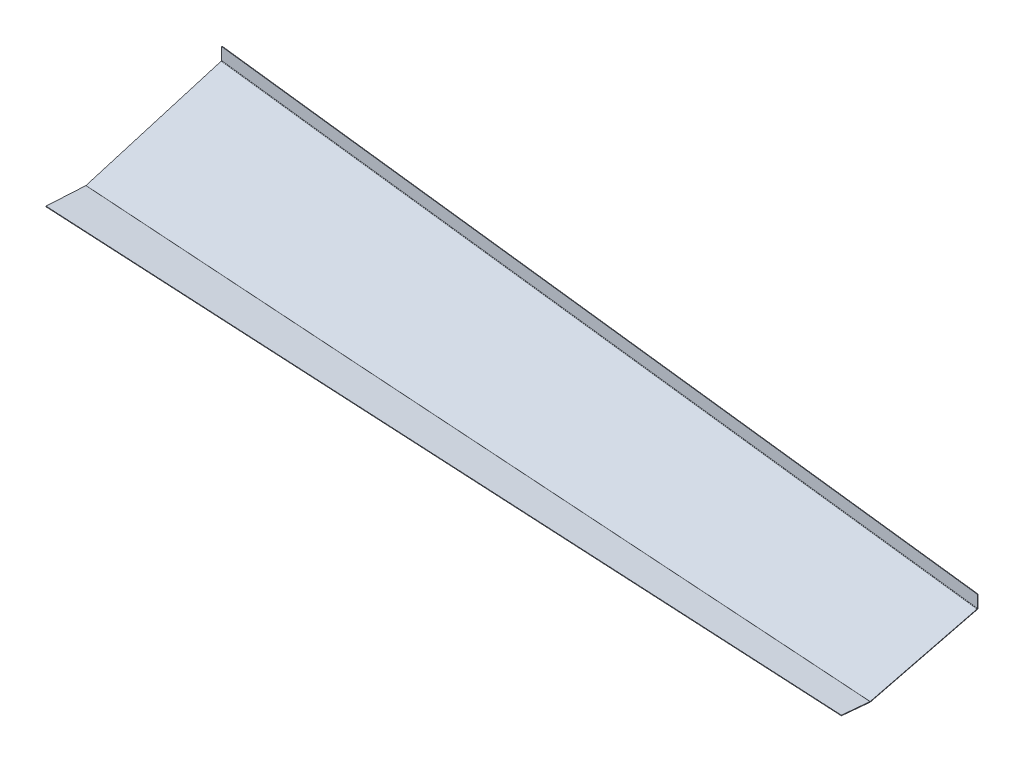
ISO-10303-21;
HEADER;
FILE_DESCRIPTION(('STEP AP214'),'2;1');
FILE_NAME('part.step','',(''),(''),'','','');
FILE_SCHEMA(('AUTOMOTIVE_DESIGN { 1 0 10303 214 1 1 1 1 }'));
ENDSEC;
DATA;
#1=APPLICATION_CONTEXT('core data for automotive mechanical design processes');
#2=APPLICATION_PROTOCOL_DEFINITION('international standard','automotive_design',2000,#1);
#3=PRODUCT_CONTEXT('',#1,'mechanical');
#4=PRODUCT('Part','Part','',(#3));
#5=PRODUCT_RELATED_PRODUCT_CATEGORY('part','',(#4));
#6=PRODUCT_DEFINITION_FORMATION('','',#4);
#7=PRODUCT_DEFINITION_CONTEXT('part definition',#1,'design');
#8=PRODUCT_DEFINITION('design','',#6,#7);
#9=PRODUCT_DEFINITION_SHAPE('','',#8);
#10=(LENGTH_UNIT() NAMED_UNIT(*) SI_UNIT(.MILLI.,.METRE.));
#11=(NAMED_UNIT(*) PLANE_ANGLE_UNIT() SI_UNIT($,.RADIAN.));
#12=(NAMED_UNIT(*) SI_UNIT($,.STERADIAN.) SOLID_ANGLE_UNIT());
#13=UNCERTAINTY_MEASURE_WITH_UNIT(LENGTH_MEASURE(1.E-05),#10,'distance_accuracy_value','');
#14=(GEOMETRIC_REPRESENTATION_CONTEXT(3) GLOBAL_UNCERTAINTY_ASSIGNED_CONTEXT((#13)) GLOBAL_UNIT_ASSIGNED_CONTEXT((#10,
#11,#12)) REPRESENTATION_CONTEXT('',''));
#15=CARTESIAN_POINT('',(0.,0.,0.));
#16=DIRECTION('',(0.,0.,1.));
#17=DIRECTION('',(1.,0.,0.));
#18=AXIS2_PLACEMENT_3D('',#15,#16,#17);
#19=CARTESIAN_POINT('',(-98.9377223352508,-360.42650834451,-114.930927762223));
#20=DIRECTION('',(-0.997086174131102,-0.0111059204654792,-0.0754706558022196));
#21=DIRECTION('',(-0.0691618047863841,-0.285793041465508,0.955792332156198));
#22=AXIS2_PLACEMENT_3D('',#19,#20,#21);
#23=PLANE('',#22);
#24=DIRECTION('',(-0.0321839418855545,0.95822700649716,0.284192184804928));
#25=VECTOR('',#24,1.);
#26=CARTESIAN_POINT('',(-44.5595716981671,-135.723045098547,-866.418249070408));
#27=LINE('',#26,#25);
#28=CARTESIAN_POINT('',(-44.5072534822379,-137.280738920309,-866.880231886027));
#29=VERTEX_POINT('',#28);
#30=CARTESIAN_POINT('',(-44.5595716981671,-135.723045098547,-866.418249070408));
#31=VERTEX_POINT('',#30);
#32=EDGE_CURVE('E13',#29,#31,#27,.T.);
#33=ORIENTED_EDGE('',*,*,#32,.F.);
#34=DIRECTION('',(-0.0691618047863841,-0.285793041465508,0.955792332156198));
#35=VECTOR('',#34,1.);
#36=CARTESIAN_POINT('',(-98.8854041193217,-361.984202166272,-115.392910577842));
#37=LINE('',#36,#35);
#38=CARTESIAN_POINT('',(-44.4850191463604,-137.188861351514,-867.187502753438));
#39=VERTEX_POINT('',#38);
#40=EDGE_CURVE('E370',#39,#29,#37,.T.);
#41=ORIENTED_EDGE('',*,*,#40,.F.);
#42=DIRECTION('',(-0.0321839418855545,0.95822700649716,0.284192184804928));
#43=VECTOR('',#42,1.);
#44=CARTESIAN_POINT('',(-44.5373373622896,-135.631167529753,-866.725519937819));
#45=LINE('',#44,#43);
#46=CARTESIAN_POINT('',(-44.5373373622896,-135.631167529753,-866.725519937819));
#47=VERTEX_POINT('',#46);
#48=EDGE_CURVE('E205',#39,#47,#45,.T.);
#49=ORIENTED_EDGE('',*,*,#48,.T.);
#50=DIRECTION('',(-0.0691618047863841,-0.285793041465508,0.955792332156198));
#51=VECTOR('',#50,1.);
#52=CARTESIAN_POINT('',(-98.9377223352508,-360.42650834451,-114.930927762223));
#53=LINE('',#52,#51);
#54=EDGE_CURVE('E465',#47,#31,#53,.T.);
#55=ORIENTED_EDGE('',*,*,#54,.T.);
#56=EDGE_LOOP('',(#33,#41,#49,#55));
#57=FACE_BOUND('',#56,.T.);
#58=ADVANCED_FACE('F194',(#57),#23,.F.);
#59=CARTESIAN_POINT('',(-32.7570325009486,-44.8590499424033,-1171.45296316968));
#60=DIRECTION('',(-0.998795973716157,-0.0203014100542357,-0.0446593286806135));
#61=DIRECTION('',(-0.0370242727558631,-0.285287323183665,0.95772665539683));
#62=AXIS2_PLACEMENT_3D('',#59,#60,#61);
#63=PLANE('',#62);
#64=ORIENTED_EDGE('',*,*,#48,.F.);
#65=DIRECTION('',(-0.0370242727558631,-0.285287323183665,0.95772665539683));
#66=VECTOR('',#65,1.);
#67=CARTESIAN_POINT('',(-32.7047142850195,-46.4167437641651,-1171.9149459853));
#68=LINE('',#67,#66);
#69=CARTESIAN_POINT('',(-32.7501898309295,-46.7671516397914,-1170.73860572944));
#70=VERTEX_POINT('',#69);
#71=EDGE_CURVE('E400',#70,#39,#68,.T.);
#72=ORIENTED_EDGE('',*,*,#71,.F.);
#73=DIRECTION('',(-0.0321839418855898,0.958227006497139,0.284192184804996));
#74=VECTOR('',#73,1.);
#75=CARTESIAN_POINT('',(-32.8025080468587,-45.2094578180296,-1170.27662291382));
#76=LINE('',#75,#74);
#77=CARTESIAN_POINT('',(-32.8025080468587,-45.2094578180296,-1170.27662291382));
#78=VERTEX_POINT('',#77);
#79=EDGE_CURVE('E459',#70,#78,#76,.T.);
#80=ORIENTED_EDGE('',*,*,#79,.T.);
#81=DIRECTION('',(-0.0370242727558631,-0.285287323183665,0.95772665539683));
#82=VECTOR('',#81,1.);
#83=CARTESIAN_POINT('',(-32.7570325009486,-44.8590499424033,-1171.45296316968));
#84=LINE('',#83,#82);
#85=EDGE_CURVE('E469',#78,#47,#84,.T.);
#86=ORIENTED_EDGE('',*,*,#85,.T.);
#87=EDGE_LOOP('',(#64,#72,#80,#86));
#88=FACE_BOUND('',#87,.T.);
#89=ADVANCED_FACE('F470',(#88),#63,.F.);
#90=CARTESIAN_POINT('',(-32.8876456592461,-43.6951706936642,-1168.18294925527));
#91=CARTESIAN_POINT('',(-32.9485989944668,-43.7096395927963,-1167.64471619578));
#92=CARTESIAN_POINT('',(-33.0095523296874,-43.7241084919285,-1167.10648313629));
#93=CARTESIAN_POINT('',(-33.0705056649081,-43.7385773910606,-1166.5682500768));
#94=CARTESIAN_POINT('',(-32.8778767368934,-46.9452114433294,-1168.26921126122));
#95=CARTESIAN_POINT('',(-32.9355737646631,-48.0430272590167,-1167.75973220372));
#96=CARTESIAN_POINT('',(-32.9932707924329,-49.1408430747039,-1167.25025314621));
#97=CARTESIAN_POINT('',(-33.0509678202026,-50.238658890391,-1166.74077408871));
#98=CARTESIAN_POINT('',(-32.7502559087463,-46.8583980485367,-1171.5255736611));
#99=CARTESIAN_POINT('',(-32.6860462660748,-47.9272760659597,-1172.09256072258));
#100=CARTESIAN_POINT('',(-32.6218366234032,-48.9961540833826,-1172.65954778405));
#101=CARTESIAN_POINT('',(-32.5576269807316,-50.0650321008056,-1173.22653484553));
#102=CARTESIAN_POINT('',(-32.760024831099,-43.6083572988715,-1171.43931165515));
#103=CARTESIAN_POINT('',(-32.6990714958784,-43.5938883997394,-1171.97754471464));
#104=CARTESIAN_POINT('',(-32.6381181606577,-43.5794195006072,-1172.51577777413));
#105=CARTESIAN_POINT('',(-32.5771648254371,-43.5649506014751,-1173.05401083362));
#106=CARTESIAN_POINT('',(-32.7697937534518,-40.3583165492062,-1171.35304964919));
#107=CARTESIAN_POINT('',(-32.712096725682,-39.2605007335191,-1171.8625287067));
#108=CARTESIAN_POINT('',(-32.6543996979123,-38.1626849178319,-1172.3720077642));
#109=CARTESIAN_POINT('',(-32.5967026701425,-37.0648691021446,-1172.8814868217));
#110=CARTESIAN_POINT('',(-32.8974145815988,-40.445129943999,-1168.09668724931));
#111=CARTESIAN_POINT('',(-32.9616242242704,-39.376251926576,-1167.52970018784));
#112=CARTESIAN_POINT('',(-33.025833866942,-38.3073739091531,-1166.96271312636));
#113=CARTESIAN_POINT('',(-33.0900435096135,-37.2384958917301,-1166.39572606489));
#114=CARTESIAN_POINT('',(-32.8876456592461,-43.6951706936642,-1168.18294925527));
#115=CARTESIAN_POINT('',(-32.9485989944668,-43.7096395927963,-1167.64471619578));
#116=CARTESIAN_POINT('',(-33.0095523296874,-43.7241084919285,-1167.10648313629));
#117=CARTESIAN_POINT('',(-33.0705056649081,-43.7385773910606,-1166.5682500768));
#118=(BOUNDED_SURFACE() B_SPLINE_SURFACE(3,3,((#90,#91,#92,#93),(#94,#95,#96,#97),(#98,#99,#100,
#101),(#102,#103,#104,#105),(#106,#107,#108,#109),(#110,#111,#112,#113),(#114,#115,#116,#117)),
.UNSPECIFIED.,.T.,.F.,.F.) B_SPLINE_SURFACE_WITH_KNOTS((4,3,4),(4,4),(0.,0.5,1.),(0.,1.),
.UNSPECIFIED.) GEOMETRIC_REPRESENTATION_ITEM() RATIONAL_B_SPLINE_SURFACE(((1.,1.,1.,1.),
(0.333333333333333,0.333333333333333,0.333333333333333,0.333333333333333),(0.333333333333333,
0.333333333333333,0.333333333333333,0.333333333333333),(1.,1.,1.,1.),(0.333333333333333,
0.333333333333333,0.333333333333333,0.333333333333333),(0.333333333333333,0.333333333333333,
0.333333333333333,0.333333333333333),(1.,1.,1.,1.))) REPRESENTATION_ITEM('') SURFACE());
#119=CARTESIAN_POINT('',(-32.8238352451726,-43.6517639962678,-1169.81113045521));
#120=DIRECTION('',(0.997117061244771,0.000983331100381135,0.0758722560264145));
#121=DIRECTION('',(-0.0758191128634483,-0.0266838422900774,0.996764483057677));
#122=AXIS2_PLACEMENT_3D('',#119,#120,#121);
#123=ELLIPSE('',#122,3.2534068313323,3.2512);
#124=CARTESIAN_POINT('',(-32.5769919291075,-43.6517639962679,-1173.0551579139));
#125=VERTEX_POINT('',#124);
#126=EDGE_CURVE('E404',#70,#125,#123,.T.);
#127=DIRECTION('',(-0.11252782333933,0.,0.993648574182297));
#128=VECTOR('',#127,1.);
#129=CARTESIAN_POINT('',(-32.7599171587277,-43.6517639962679,-1171.43988279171));
#130=LINE('',#129,#128);
#131=CARTESIAN_POINT('',(-32.7599171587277,-43.6517639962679,-1171.43988279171));
#132=VERTEX_POINT('',#131);
#133=EDGE_CURVE('E454',#125,#132,#130,.T.);
#134=CARTESIAN_POINT('',(-32.8238352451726,-43.6517639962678,-1169.81113045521));
#135=DIRECTION('',(0.999228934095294,0.00196267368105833,0.0392133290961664));
#136=DIRECTION('',(-0.039147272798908,-0.0266297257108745,0.998878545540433));
#137=AXIS2_PLACEMENT_3D('',#134,#135,#136);
#138=ELLIPSE('',#137,1.63000918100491,1.6256);
#139=EDGE_CURVE('E356',#78,#132,#138,.T.);
#140=ORIENTED_EDGE('',*,*,#79,.F.);
#141=ORIENTED_EDGE('',*,*,#126,.T.);
#142=ORIENTED_EDGE('',*,*,#133,.T.);
#143=ORIENTED_EDGE('',*,*,#139,.F.);
#144=EDGE_LOOP('',(#140,#141,#142,#143));
#145=FACE_BOUND('',#144,.T.);
#146=ADVANCED_FACE('F567',(#145),#118,.F.);
#147=CARTESIAN_POINT('',(-32.755177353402,-46.0756,-1171.43934602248));
#148=DIRECTION('',(-0.99364664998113,-0.00196799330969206,-0.11252760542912));
#149=DIRECTION('',(-0.00195549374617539,0.999998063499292,-0.000221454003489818));
#150=AXIS2_PLACEMENT_3D('',#147,#148,#149);
#151=PLANE('',#150);
#152=ORIENTED_EDGE('',*,*,#133,.F.);
#153=DIRECTION('',(-0.00195549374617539,0.999998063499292,-0.000221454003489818));
#154=VECTOR('',#153,1.);
#155=CARTESIAN_POINT('',(-32.5722521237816,-46.0756,-1173.05462114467));
#156=LINE('',#155,#154);
#157=CARTESIAN_POINT('',(-32.6467565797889,-7.97559999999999,-1173.06305855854));
#158=VERTEX_POINT('',#157);
#159=EDGE_CURVE('E379',#125,#158,#156,.T.);
#160=ORIENTED_EDGE('',*,*,#159,.T.);
#161=DIRECTION('',(-0.11252782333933,0.,0.993648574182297));
#162=VECTOR('',#161,1.);
#163=CARTESIAN_POINT('',(-32.8296818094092,-7.97559999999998,-1171.44778343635));
#164=LINE('',#163,#162);
#165=CARTESIAN_POINT('',(-32.8296818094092,-7.97559999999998,-1171.44778343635));
#166=VERTEX_POINT('',#165);
#167=EDGE_CURVE('E451',#158,#166,#164,.T.);
#168=ORIENTED_EDGE('',*,*,#167,.T.);
#169=DIRECTION('',(-0.00195549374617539,0.999998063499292,-0.000221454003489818));
#170=VECTOR('',#169,1.);
#171=CARTESIAN_POINT('',(-32.755177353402,-46.0756,-1171.43934602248));
#172=LINE('',#171,#170);
#173=EDGE_CURVE('E489',#132,#166,#172,.T.);
#174=ORIENTED_EDGE('',*,*,#173,.F.);
#175=EDGE_LOOP('',(#152,#160,#168,#174));
#176=FACE_BOUND('',#175,.T.);
#177=ADVANCED_FACE('F535',(#176),#151,.F.);
#178=CARTESIAN_POINT('',(-32.8296818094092,-7.97559999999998,-1171.44778343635));
#179=DIRECTION('',(0.,-1.,0.));
#180=DIRECTION('',(-0.993648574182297,0.,-0.11252782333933));
#181=AXIS2_PLACEMENT_3D('',#178,#179,#180);
#182=PLANE('',#181);
#183=ORIENTED_EDGE('',*,*,#167,.F.);
#184=DIRECTION('',(-0.993648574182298,0.,-0.11252782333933));
#185=VECTOR('',#184,1.);
#186=CARTESIAN_POINT('',(130.869125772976,-7.9756,-1154.54535843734));
#187=LINE('',#186,#185);
#188=CARTESIAN_POINT('',(-2552.51707477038,-7.97559999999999,-1458.43107434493));
#189=VERTEX_POINT('',#188);
#190=EDGE_CURVE('E409',#158,#189,#187,.T.);
#191=ORIENTED_EDGE('',*,*,#190,.T.);
#192=DIRECTION('',(-0.11252782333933,0.,0.993648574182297));
#193=VECTOR('',#192,1.);
#194=CARTESIAN_POINT('',(-2552.7,-7.97559999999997,-1456.81579922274));
#195=LINE('',#194,#193);
#196=CARTESIAN_POINT('',(-2552.7,-7.97559999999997,-1456.81579922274));
#197=VERTEX_POINT('',#196);
#198=EDGE_CURVE('E448',#189,#197,#195,.T.);
#199=ORIENTED_EDGE('',*,*,#198,.T.);
#200=DIRECTION('',(-0.993648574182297,0.,-0.11252782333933));
#201=VECTOR('',#200,1.);
#202=CARTESIAN_POINT('',(-32.8296818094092,-7.97559999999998,-1171.44778343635));
#203=LINE('',#202,#201);
#204=EDGE_CURVE('E474',#166,#197,#203,.T.);
#205=ORIENTED_EDGE('',*,*,#204,.F.);
#206=EDGE_LOOP('',(#183,#191,#199,#205));
#207=FACE_BOUND('',#206,.T.);
#208=ADVANCED_FACE('F537',(#207),#182,.F.);
#209=CARTESIAN_POINT('',(-2552.7,-1.86058804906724E-11,-1456.81579922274));
#210=DIRECTION('',(0.993648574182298,0.,0.11252782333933));
#211=DIRECTION('',(0.,-1.,0.));
#212=AXIS2_PLACEMENT_3D('',#209,#210,#211);
#213=PLANE('',#212);
#214=ORIENTED_EDGE('',*,*,#198,.F.);
#215=DIRECTION('',(0.,1.,0.));
#216=VECTOR('',#215,1.);
#217=CARTESIAN_POINT('',(-2552.51707477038,-1.4749395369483E-11,-1458.43107434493));
#218=LINE('',#217,#216);
#219=CARTESIAN_POINT('',(-2552.51707477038,-43.6517639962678,-1458.43107434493));
#220=VERTEX_POINT('',#219);
#221=EDGE_CURVE('E405',#189,#220,#218,.F.);
#222=ORIENTED_EDGE('',*,*,#221,.T.);
#223=DIRECTION('',(-0.112527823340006,0.,0.993648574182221));
#224=VECTOR('',#223,1.);
#225=CARTESIAN_POINT('',(-2552.7,-43.6517639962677,-1456.81579922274));
#226=LINE('',#225,#224);
#227=CARTESIAN_POINT('',(-2552.7,-43.6517639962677,-1456.81579922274));
#228=VERTEX_POINT('',#227);
#229=EDGE_CURVE('E445',#220,#228,#226,.T.);
#230=ORIENTED_EDGE('',*,*,#229,.T.);
#231=DIRECTION('',(0.,-1.,0.));
#232=VECTOR('',#231,1.);
#233=CARTESIAN_POINT('',(-2552.7,-1.86058804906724E-11,-1456.81579922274));
#234=LINE('',#233,#232);
#235=EDGE_CURVE('E493',#197,#228,#234,.T.);
#236=ORIENTED_EDGE('',*,*,#235,.F.);
#237=EDGE_LOOP('',(#214,#222,#230,#236));
#238=FACE_BOUND('',#237,.T.);
#239=ADVANCED_FACE('F540',(#238),#213,.F.);
#240=CARTESIAN_POINT('',(-2552.7,-43.6517639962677,-1453.54381747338));
#241=CARTESIAN_POINT('',(-2552.76097507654,-43.6517639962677,-1453.00539243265));
#242=CARTESIAN_POINT('',(-2552.82195015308,-43.6517639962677,-1452.46696739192));
#243=CARTESIAN_POINT('',(-2552.88292522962,-43.6517639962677,-1451.92854235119));
#244=CARTESIAN_POINT('',(-2552.7,-40.4005639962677,-1453.54381747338));
#245=CARTESIAN_POINT('',(-2552.76097507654,-39.3168306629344,-1453.00539243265));
#246=CARTESIAN_POINT('',(-2552.82195015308,-38.2330973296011,-1452.46696739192));
#247=CARTESIAN_POINT('',(-2552.88292522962,-37.1493639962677,-1451.92854235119));
#248=CARTESIAN_POINT('',(-2552.7,-40.4005639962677,-1456.81579922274));
#249=CARTESIAN_POINT('',(-2552.63902492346,-39.3168306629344,-1457.35422426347));
#250=CARTESIAN_POINT('',(-2552.57804984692,-38.2330973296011,-1457.8926493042));
#251=CARTESIAN_POINT('',(-2552.51707477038,-37.1493639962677,-1458.43107434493));
#252=CARTESIAN_POINT('',(-2552.7,-43.6517639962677,-1456.81579922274));
#253=CARTESIAN_POINT('',(-2552.63902492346,-43.6517639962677,-1457.35422426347));
#254=CARTESIAN_POINT('',(-2552.57804984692,-43.6517639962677,-1457.8926493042));
#255=CARTESIAN_POINT('',(-2552.51707477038,-43.6517639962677,-1458.43107434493));
#256=CARTESIAN_POINT('',(-2552.7,-46.9029639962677,-1456.81579922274));
#257=CARTESIAN_POINT('',(-2552.63902492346,-47.9866973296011,-1457.35422426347));
#258=CARTESIAN_POINT('',(-2552.57804984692,-49.0704306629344,-1457.8926493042));
#259=CARTESIAN_POINT('',(-2552.51707477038,-50.1541639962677,-1458.43107434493));
#260=CARTESIAN_POINT('',(-2552.7,-46.9029639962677,-1453.54381747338));
#261=CARTESIAN_POINT('',(-2552.76097507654,-47.9866973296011,-1453.00539243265));
#262=CARTESIAN_POINT('',(-2552.82195015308,-49.0704306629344,-1452.46696739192));
#263=CARTESIAN_POINT('',(-2552.88292522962,-50.1541639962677,-1451.92854235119));
#264=CARTESIAN_POINT('',(-2552.7,-43.6517639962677,-1453.54381747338));
#265=CARTESIAN_POINT('',(-2552.76097507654,-43.6517639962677,-1453.00539243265));
#266=CARTESIAN_POINT('',(-2552.82195015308,-43.6517639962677,-1452.46696739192));
#267=CARTESIAN_POINT('',(-2552.88292522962,-43.6517639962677,-1451.92854235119));
#268=(BOUNDED_SURFACE() B_SPLINE_SURFACE(3,3,((#240,#241,#242,#243),(#244,#245,#246,#247),(#248,
#249,#250,#251),(#252,#253,#254,#255),(#256,#257,#258,#259),(#260,#261,#262,#263),(#264,#265,
#266,#267)),.UNSPECIFIED.,.T.,.F.,.F.) B_SPLINE_SURFACE_WITH_KNOTS((4,3,4),(4,4),(0.,0.5,1.),
(0.,1.),.UNSPECIFIED.) GEOMETRIC_REPRESENTATION_ITEM() RATIONAL_B_SPLINE_SURFACE(((1.,1.,1.,1.),
(0.333333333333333,0.333333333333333,0.333333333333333,0.333333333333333),(0.333333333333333,
0.333333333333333,0.333333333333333,0.333333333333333),(1.,1.,1.,1.),(0.333333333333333,
0.333333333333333,0.333333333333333,0.333333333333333),(0.333333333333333,0.333333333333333,
0.333333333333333,0.333333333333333),(1.,1.,1.,1.))) REPRESENTATION_ITEM('') SURFACE());
#269=CARTESIAN_POINT('',(-2552.7,-43.6517639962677,-1455.17980834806));
#270=DIRECTION('',(-0.99842099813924,0.,-0.0561739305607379));
#271=DIRECTION('',(-0.0561739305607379,0.,0.99842099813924));
#272=AXIS2_PLACEMENT_3D('',#269,#270,#271);
#273=ELLIPSE('',#272,3.25640787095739,3.2512);
#274=CARTESIAN_POINT('',(-2552.64768178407,-46.7671516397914,-1456.10969886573));
#275=VERTEX_POINT('',#274);
#276=EDGE_CURVE('E393',#220,#275,#273,.T.);
#277=DIRECTION('',(-0.0321839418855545,0.95822700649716,0.284192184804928));
#278=VECTOR('',#277,1.);
#279=CARTESIAN_POINT('',(-2552.7,-45.2094578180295,-1455.64771605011));
#280=LINE('',#279,#278);
#281=CARTESIAN_POINT('',(-2552.7,-45.2094578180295,-1455.64771605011));
#282=VERTEX_POINT('',#281);
#283=EDGE_CURVE('E442',#275,#282,#280,.T.);
#284=CARTESIAN_POINT('',(-2552.7,-43.6517639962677,-1455.17980834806));
#285=DIRECTION('',(-1.,0.,0.));
#286=DIRECTION('',(0.,0.,1.));
#287=AXIS2_PLACEMENT_3D('',#284,#285,#286);
#288=ELLIPSE('',#287,1.63599087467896,1.6256);
#289=EDGE_CURVE('E335',#228,#282,#288,.T.);
#290=ORIENTED_EDGE('',*,*,#229,.F.);
#291=ORIENTED_EDGE('',*,*,#276,.T.);
#292=ORIENTED_EDGE('',*,*,#283,.T.);
#293=ORIENTED_EDGE('',*,*,#289,.F.);
#294=EDGE_LOOP('',(#290,#291,#292,#293));
#295=FACE_BOUND('',#294,.T.);
#296=ADVANCED_FACE('F524',(#295),#268,.F.);
#297=CARTESIAN_POINT('',(-2552.7,-438.368241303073,-130.011810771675));
#298=DIRECTION('',(0.999481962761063,0.0308555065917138,0.00915116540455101));
#299=DIRECTION('',(0.,0.28433948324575,-0.958723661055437));
#300=AXIS2_PLACEMENT_3D('',#297,#298,#299);
#301=PLANE('',#300);
#302=ORIENTED_EDGE('',*,*,#283,.F.);
#303=DIRECTION('',(0.,-0.28433948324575,0.958723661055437));
#304=VECTOR('',#303,1.);
#305=CARTESIAN_POINT('',(-2552.64768178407,-439.925935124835,-130.473793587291));
#306=LINE('',#305,#304);
#307=CARTESIAN_POINT('',(-2552.64768178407,-165.217349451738,-1056.72440772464));
#308=VERTEX_POINT('',#307);
#309=EDGE_CURVE('E384',#308,#275,#306,.F.);
#310=ORIENTED_EDGE('',*,*,#309,.F.);
#311=DIRECTION('',(-0.0321839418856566,0.958227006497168,0.284192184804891));
#312=VECTOR('',#311,1.);
#313=CARTESIAN_POINT('',(-2552.7,-163.659655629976,-1056.26242490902));
#314=LINE('',#313,#312);
#315=CARTESIAN_POINT('',(-2552.7,-163.659655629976,-1056.26242490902));
#316=VERTEX_POINT('',#315);
#317=EDGE_CURVE('E315',#308,#316,#314,.T.);
#318=ORIENTED_EDGE('',*,*,#317,.T.);
#319=DIRECTION('',(0.,0.28433948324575,-0.958723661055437));
#320=VECTOR('',#319,1.);
#321=CARTESIAN_POINT('',(-2552.7,-438.368241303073,-130.011810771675));
#322=LINE('',#321,#320);
#323=EDGE_CURVE('E475',#316,#282,#322,.T.);
#324=ORIENTED_EDGE('',*,*,#323,.T.);
#325=EDGE_LOOP('',(#302,#310,#318,#324));
#326=FACE_BOUND('',#325,.T.);
#327=ADVANCED_FACE('F554',(#326),#301,.F.);
#328=CARTESIAN_POINT('',(-2552.82400634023,-161.628042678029,-1052.57990871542));
#329=CARTESIAN_POINT('',(-2552.78267089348,-161.706701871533,-1053.11443990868));
#330=CARTESIAN_POINT('',(-2552.74133544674,-161.785361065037,-1053.64897110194));
#331=CARTESIAN_POINT('',(-2552.7,-161.864020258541,-1054.18350229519));
#332=CARTESIAN_POINT('',(-2552.82400634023,-155.194923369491,-1053.52657746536));
#333=CARTESIAN_POINT('',(-2552.78267089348,-156.345769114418,-1053.90333053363));
#334=CARTESIAN_POINT('',(-2552.74133544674,-157.496614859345,-1054.2800836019));
#335=CARTESIAN_POINT('',(-2552.7,-158.647460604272,-1054.65683667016));
#336=CARTESIAN_POINT('',(-2552.57599365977,-156.141596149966,-1059.95972416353));
#337=CARTESIAN_POINT('',(-2552.61732910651,-157.135123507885,-1059.26741484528));
#338=CARTESIAN_POINT('',(-2552.65866455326,-158.128650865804,-1058.57510552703));
#339=CARTESIAN_POINT('',(-2552.7,-159.122178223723,-1057.88279620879));
#340=CARTESIAN_POINT('',(-2552.57599365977,-162.574715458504,-1059.01305541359));
#341=CARTESIAN_POINT('',(-2552.61732910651,-162.496056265,-1058.47852422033));
#342=CARTESIAN_POINT('',(-2552.65866455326,-162.417397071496,-1057.94399302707));
#343=CARTESIAN_POINT('',(-2552.7,-162.338737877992,-1057.40946183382));
#344=CARTESIAN_POINT('',(-2552.57599365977,-169.007834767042,-1058.06638666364));
#345=CARTESIAN_POINT('',(-2552.61732910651,-167.856989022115,-1057.68963359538));
#346=CARTESIAN_POINT('',(-2552.65866455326,-166.706143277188,-1057.31288052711));
#347=CARTESIAN_POINT('',(-2552.7,-165.555297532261,-1056.93612745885));
#348=CARTESIAN_POINT('',(-2552.82400634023,-168.061161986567,-1051.63323996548));
#349=CARTESIAN_POINT('',(-2552.78267089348,-167.067634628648,-1052.32554928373));
#350=CARTESIAN_POINT('',(-2552.74133544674,-166.074107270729,-1053.01785860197));
#351=CARTESIAN_POINT('',(-2552.7,-165.08057991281,-1053.71016792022));
#352=CARTESIAN_POINT('',(-2552.82400634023,-161.628042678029,-1052.57990871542));
#353=CARTESIAN_POINT('',(-2552.78267089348,-161.706701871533,-1053.11443990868));
#354=CARTESIAN_POINT('',(-2552.74133544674,-161.785361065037,-1053.64897110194));
#355=CARTESIAN_POINT('',(-2552.7,-161.864020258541,-1054.18350229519));
#356=(BOUNDED_SURFACE() B_SPLINE_SURFACE(3,3,((#328,#329,#330,#331),(#332,#333,#334,#335),(#336,
#337,#338,#339),(#340,#341,#342,#343),(#344,#345,#346,#347),(#348,#349,#350,#351),(#352,#353,
#354,#355)),.UNSPECIFIED.,.T.,.F.,.F.) B_SPLINE_SURFACE_WITH_KNOTS((4,3,4),(4,4),(0.,0.5,1.),
(0.,1.),.UNSPECIFIED.) GEOMETRIC_REPRESENTATION_ITEM() RATIONAL_B_SPLINE_SURFACE(((1.,1.,1.,1.),
(0.333333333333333,0.333333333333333,0.333333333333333,0.333333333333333),(0.333333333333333,
0.333333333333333,0.333333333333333,0.333333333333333),(1.,1.,1.,1.),(0.333333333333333,
0.333333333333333,0.333333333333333,0.333333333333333),(0.333333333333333,0.333333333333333,
0.333333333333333,0.333333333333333),(1.,1.,1.,1.))) REPRESENTATION_ITEM('') SURFACE());
#357=CARTESIAN_POINT('',(-2552.7,-162.101379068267,-1055.7964820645));
#358=DIRECTION('',(0.999273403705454,0.00554890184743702,0.037707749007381));
#359=DIRECTION('',(-0.0381138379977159,0.145481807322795,0.988626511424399));
#360=AXIS2_PLACEMENT_3D('',#357,#358,#359);
#361=ELLIPSE('',#360,3.2535778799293,3.2512);
#362=CARTESIAN_POINT('',(-2552.68850703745,-165.347963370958,-1055.62329840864));
#363=VERTEX_POINT('',#362);
#364=EDGE_CURVE('E312',#308,#363,#361,.F.);
#365=DIRECTION('',(-0.00706998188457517,0.998540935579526,-0.0535351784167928));
#366=VECTOR('',#365,1.);
#367=CARTESIAN_POINT('',(-2552.7,-163.72473522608,-1055.71032519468));
#368=LINE('',#367,#366);
#369=CARTESIAN_POINT('',(-2552.7,-163.72473522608,-1055.71032519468));
#370=VERTEX_POINT('',#369);
#371=EDGE_CURVE('E306',#363,#370,#368,.T.);
#372=CARTESIAN_POINT('',(-2552.7,-162.101379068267,-1055.7964820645));
#373=DIRECTION('',(1.,0.,0.));
#374=DIRECTION('',(0.,0.145587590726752,0.989345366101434));
#375=AXIS2_PLACEMENT_3D('',#372,#373,#374);
#376=ELLIPSE('',#375,1.6303505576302,1.6256);
#377=EDGE_CURVE('E309',#316,#370,#376,.F.);
#378=ORIENTED_EDGE('',*,*,#317,.F.);
#379=ORIENTED_EDGE('',*,*,#364,.T.);
#380=ORIENTED_EDGE('',*,*,#371,.T.);
#381=ORIENTED_EDGE('',*,*,#377,.F.);
#382=EDGE_LOOP('',(#378,#379,#380,#381));
#383=FACE_BOUND('',#382,.T.);
#384=ADVANCED_FACE('F308',(#383),#356,.T.);
#385=CARTESIAN_POINT('',(-2552.7,-106.81747539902,5.72684844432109));
#386=DIRECTION('',(0.99997500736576,0.00705984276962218,-0.000378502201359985));
#387=DIRECTION('',(0.,-0.0535365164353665,-0.998565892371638));
#388=AXIS2_PLACEMENT_3D('',#385,#386,#387);
#389=PLANE('',#388);
#390=ORIENTED_EDGE('',*,*,#371,.F.);
#391=DIRECTION('',(0.,0.0535365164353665,0.998565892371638));
#392=VECTOR('',#391,1.);
#393=CARTESIAN_POINT('',(-2552.68850703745,-108.440703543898,5.81387523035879));
#394=LINE('',#393,#392);
#395=CARTESIAN_POINT('',(-2552.68850703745,-159.040451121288,-937.97525147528));
#396=VERTEX_POINT('',#395);
#397=EDGE_CURVE('E389',#396,#363,#394,.F.);
#398=ORIENTED_EDGE('',*,*,#397,.F.);
#399=DIRECTION('',(-0.00706998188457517,0.998540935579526,-0.0535351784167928));
#400=VECTOR('',#399,1.);
#401=CARTESIAN_POINT('',(-2552.7,-157.41722297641,-938.062278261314));
#402=LINE('',#401,#400);
#403=CARTESIAN_POINT('',(-2552.7,-157.41722297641,-938.062278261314));
#404=VERTEX_POINT('',#403);
#405=EDGE_CURVE('E268',#396,#404,#402,.T.);
#406=ORIENTED_EDGE('',*,*,#405,.T.);
#407=DIRECTION('',(0.,-0.0535365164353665,-0.998565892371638));
#408=VECTOR('',#407,1.);
#409=CARTESIAN_POINT('',(-2552.7,-106.81747539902,5.72684844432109));
#410=LINE('',#409,#408);
#411=EDGE_CURVE('E328',#404,#370,#410,.T.);
#412=ORIENTED_EDGE('',*,*,#411,.T.);
#413=EDGE_LOOP('',(#390,#398,#406,#412));
#414=FACE_BOUND('',#413,.T.);
#415=ADVANCED_FACE('F329',(#414),#389,.F.);
#416=CARTESIAN_POINT('',(-47.7749670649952,-131.44504579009,-784.434182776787));
#417=DIRECTION('',(0.0616768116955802,-0.0529991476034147,-0.996688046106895));
#418=DIRECTION('',(-0.998071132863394,-0.0103484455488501,-0.0612121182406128));
#419=AXIS2_PLACEMENT_3D('',#416,#417,#418);
#420=PLANE('',#419);
#421=ORIENTED_EDGE('',*,*,#405,.F.);
#422=DIRECTION('',(-0.998071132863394,-0.0103484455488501,-0.0612121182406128));
#423=VECTOR('',#422,1.);
#424=CARTESIAN_POINT('',(-47.7634741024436,-133.068273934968,-784.347155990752));
#425=LINE('',#424,#423);
#426=CARTESIAN_POINT('',(-47.7634741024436,-133.068273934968,-784.347155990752));
#427=VERTEX_POINT('',#426);
#428=EDGE_CURVE('E385',#427,#396,#425,.T.);
#429=ORIENTED_EDGE('',*,*,#428,.F.);
#430=DIRECTION('',(-0.00706998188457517,0.998540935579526,-0.0535351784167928));
#431=VECTOR('',#430,1.);
#432=CARTESIAN_POINT('',(-47.7749670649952,-131.44504579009,-784.434182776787));
#433=LINE('',#432,#431);
#434=CARTESIAN_POINT('',(-47.7749670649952,-131.44504579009,-784.434182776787));
#435=VERTEX_POINT('',#434);
#436=EDGE_CURVE('E433',#427,#435,#433,.T.);
#437=ORIENTED_EDGE('',*,*,#436,.T.);
#438=DIRECTION('',(-0.998071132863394,-0.0103484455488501,-0.0612121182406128));
#439=VECTOR('',#438,1.);
#440=CARTESIAN_POINT('',(-47.7749670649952,-131.44504579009,-784.434182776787));
#441=LINE('',#440,#439);
#442=EDGE_CURVE('E334',#435,#404,#441,.T.);
#443=ORIENTED_EDGE('',*,*,#442,.T.);
#444=EDGE_LOOP('',(#421,#429,#437,#443));
#445=FACE_BOUND('',#444,.T.);
#446=ADVANCED_FACE('F626',(#445),#420,.F.);
#447=CARTESIAN_POINT('',(-37.8186132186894,-144.940407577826,-1037.46523315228));
#448=DIRECTION('',(-0.999203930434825,-0.0091564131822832,-0.0388286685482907));
#449=DIRECTION('',(-0.0392622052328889,0.0532180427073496,0.997810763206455));
#450=AXIS2_PLACEMENT_3D('',#447,#448,#449);
#451=PLANE('',#450);
#452=ORIENTED_EDGE('',*,*,#436,.F.);
#453=DIRECTION('',(-0.0392622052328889,0.0532180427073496,0.997810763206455));
#454=VECTOR('',#453,1.);
#455=CARTESIAN_POINT('',(-37.8071202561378,-146.563635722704,-1037.37820636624));
#456=LINE('',#455,#454);
#457=CARTESIAN_POINT('',(-44.6022143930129,-137.353210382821,-864.68749715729));
#458=VERTEX_POINT('',#457);
#459=EDGE_CURVE('E380',#458,#427,#456,.T.);
#460=ORIENTED_EDGE('',*,*,#459,.F.);
#461=DIRECTION('',(-0.00706998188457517,0.998540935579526,-0.0535351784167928));
#462=VECTOR('',#461,1.);
#463=CARTESIAN_POINT('',(-44.6137073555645,-135.729982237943,-864.774523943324));
#464=LINE('',#463,#462);
#465=CARTESIAN_POINT('',(-44.6137073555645,-135.729982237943,-864.774523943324));
#466=VERTEX_POINT('',#465);
#467=EDGE_CURVE('E430',#458,#466,#464,.T.);
#468=ORIENTED_EDGE('',*,*,#467,.T.);
#469=DIRECTION('',(-0.0392622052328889,0.0532180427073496,0.997810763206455));
#470=VECTOR('',#469,1.);
#471=CARTESIAN_POINT('',(-37.8186132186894,-144.940407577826,-1037.46523315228));
#472=LINE('',#471,#470);
#473=EDGE_CURVE('E498',#466,#435,#472,.T.);
#474=ORIENTED_EDGE('',*,*,#473,.T.);
#475=EDGE_LOOP('',(#452,#460,#468,#474));
#476=FACE_BOUND('',#475,.T.);
#477=ADVANCED_FACE('F637',(#476),#451,.F.);
#478=CARTESIAN_POINT('',(66.318329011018,-134.49437953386,-856.377944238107));
#479=DIRECTION('',(-0.0759550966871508,0.0528456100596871,0.995709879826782));
#480=DIRECTION('',(0.997086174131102,0.0111059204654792,0.0754706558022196));
#481=AXIS2_PLACEMENT_3D('',#478,#479,#480);
#482=PLANE('',#481);
#483=ORIENTED_EDGE('',*,*,#467,.F.);
#484=DIRECTION('',(0.997086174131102,0.0111059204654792,0.0754706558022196));
#485=VECTOR('',#484,1.);
#486=CARTESIAN_POINT('',(66.3298219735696,-136.117607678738,-856.290917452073));
#487=LINE('',#486,#485);
#488=CARTESIAN_POINT('',(-44.6720084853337,-137.353987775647,-864.692779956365));
#489=VERTEX_POINT('',#488);
#490=EDGE_CURVE('E375',#489,#458,#487,.T.);
#491=ORIENTED_EDGE('',*,*,#490,.F.);
#492=DIRECTION('',(-0.00706998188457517,0.998540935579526,-0.0535351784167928));
#493=VECTOR('',#492,1.);
#494=CARTESIAN_POINT('',(-44.6835014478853,-135.730759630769,-864.779806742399));
#495=LINE('',#494,#493);
#496=CARTESIAN_POINT('',(-44.6835014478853,-135.730759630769,-864.779806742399));
#497=VERTEX_POINT('',#496);
#498=EDGE_CURVE('E427',#489,#497,#495,.T.);
#499=ORIENTED_EDGE('',*,*,#498,.T.);
#500=DIRECTION('',(0.997086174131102,0.0111059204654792,0.0754706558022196));
#501=VECTOR('',#500,1.);
#502=CARTESIAN_POINT('',(66.318329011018,-134.49437953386,-856.377944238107));
#503=LINE('',#502,#501);
#504=EDGE_CURVE('E485',#497,#466,#503,.T.);
#505=ORIENTED_EDGE('',*,*,#504,.T.);
#506=EDGE_LOOP('',(#483,#491,#499,#505));
#507=FACE_BOUND('',#506,.T.);
#508=ADVANCED_FACE('F649',(#507),#482,.F.);
#509=CARTESIAN_POINT('',(-110.373162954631,-90.0273060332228,-3.64147873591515));
#510=DIRECTION('',(-0.997086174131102,-0.0111059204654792,-0.0754706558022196));
#511=DIRECTION('',(-0.0759550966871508,0.0528456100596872,0.995709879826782));
#512=AXIS2_PLACEMENT_3D('',#509,#510,#511);
#513=PLANE('',#512);
#514=ORIENTED_EDGE('',*,*,#498,.F.);
#515=DIRECTION('',(-0.0759550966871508,0.0528456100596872,0.995709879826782));
#516=VECTOR('',#515,1.);
#517=CARTESIAN_POINT('',(-110.36166999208,-91.6505341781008,-3.55445194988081));
#518=LINE('',#517,#516);
#519=CARTESIAN_POINT('',(-44.5889039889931,-137.411807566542,-865.78221268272));
#520=VERTEX_POINT('',#519);
#521=EDGE_CURVE('E371',#520,#489,#518,.T.);
#522=ORIENTED_EDGE('',*,*,#521,.F.);
#523=DIRECTION('',(-0.0070699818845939,0.99854093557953,-0.0535351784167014));
#524=VECTOR('',#523,1.);
#525=CARTESIAN_POINT('',(-44.6003969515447,-135.788579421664,-865.869239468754));
#526=LINE('',#525,#524);
#527=CARTESIAN_POINT('',(-44.6003969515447,-135.788579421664,-865.869239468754));
#528=VERTEX_POINT('',#527);
#529=EDGE_CURVE('E198',#520,#528,#526,.T.);
#530=ORIENTED_EDGE('',*,*,#529,.T.);
#531=DIRECTION('',(-0.0759550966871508,0.0528456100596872,0.995709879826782));
#532=VECTOR('',#531,1.);
#533=CARTESIAN_POINT('',(-110.373162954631,-90.0273060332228,-3.64147873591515));
#534=LINE('',#533,#532);
#535=EDGE_CURVE('E341',#528,#497,#534,.T.);
#536=ORIENTED_EDGE('',*,*,#535,.T.);
#537=EDGE_LOOP('',(#514,#522,#530,#536));
#538=FACE_BOUND('',#537,.T.);
#539=ADVANCED_FACE('F661',(#538),#513,.F.);
#540=CARTESIAN_POINT('',(-44.6118899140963,-134.165351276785,-865.956266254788));
#541=DIRECTION('',(0.997086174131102,0.0111059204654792,0.0754706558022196));
#542=DIRECTION('',(0.0754753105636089,0.,-0.997147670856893));
#543=AXIS2_PLACEMENT_3D('',#540,#541,#542);
#544=PLANE('',#543);
#545=CARTESIAN_POINT('',(-44.6118899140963,-134.165351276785,-865.956266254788));
#546=DIRECTION('',(0.997086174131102,0.0111059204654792,0.0754706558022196));
#547=DIRECTION('',(0.0754753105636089,0.,-0.997147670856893));
#548=AXIS2_PLACEMENT_3D('',#545,#546,#547);
#549=CIRCLE('',#548,3.2512);
#550=EDGE_CURVE('E396',#520,#29,#549,.T.);
#551=ORIENTED_EDGE('',*,*,#550,.T.);
#552=ORIENTED_EDGE('',*,*,#32,.T.);
#553=CARTESIAN_POINT('',(-44.6118899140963,-134.165351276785,-865.956266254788));
#554=DIRECTION('',(-0.997086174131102,-0.0111059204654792,-0.0754706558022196));
#555=DIRECTION('',(-0.0754753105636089,0.,0.997147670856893));
#556=AXIS2_PLACEMENT_3D('',#553,#554,#555);
#557=CIRCLE('',#556,1.6256);
#558=EDGE_CURVE('E325',#528,#31,#557,.F.);
#559=ORIENTED_EDGE('',*,*,#558,.F.);
#560=ORIENTED_EDGE('',*,*,#529,.F.);
#561=EDGE_LOOP('',(#551,#552,#559,#560));
#562=FACE_BOUND('',#561,.T.);
#563=ADVANCED_FACE('F196',(#562),#544,.T.);
#564=CARTESIAN_POINT('',(0.628667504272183,-88.7909259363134,4.76038376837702));
#565=DIRECTION('',(-0.00706998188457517,0.998540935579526,-0.0535351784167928));
#566=DIRECTION('',(0.,0.0535365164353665,0.998565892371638));
#567=AXIS2_PLACEMENT_3D('',#564,#565,#566);
#568=PLANE('',#567);
#569=ORIENTED_EDGE('',*,*,#535,.F.);
#570=DIRECTION('',(-0.997086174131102,-0.0111059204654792,-0.0754706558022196));
#571=VECTOR('',#570,1.);
#572=CARTESIAN_POINT('',(-2552.72136819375,-163.724973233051,-1055.71194257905));
#573=LINE('',#572,#571);
#574=EDGE_CURVE('E321',#528,#370,#573,.T.);
#575=ORIENTED_EDGE('',*,*,#574,.T.);
#576=ORIENTED_EDGE('',*,*,#411,.F.);
#577=ORIENTED_EDGE('',*,*,#442,.F.);
#578=ORIENTED_EDGE('',*,*,#473,.F.);
#579=ORIENTED_EDGE('',*,*,#504,.F.);
#580=EDGE_LOOP('',(#569,#575,#576,#577,#578,#579));
#581=FACE_BOUND('',#580,.T.);
#582=ADVANCED_FACE('F338',(#581),#568,.T.);
#583=CARTESIAN_POINT('',(12.0641081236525,-359.190128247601,-106.529065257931));
#584=DIRECTION('',(-0.0321839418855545,0.95822700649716,0.284192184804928));
#585=DIRECTION('',(0.,-0.28433948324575,0.958723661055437));
#586=AXIS2_PLACEMENT_3D('',#583,#584,#585);
#587=PLANE('',#586);
#588=ORIENTED_EDGE('',*,*,#323,.F.);
#589=DIRECTION('',(-0.997086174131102,-0.0111059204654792,-0.0754706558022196));
#590=VECTOR('',#589,1.);
#591=CARTESIAN_POINT('',(-44.5595716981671,-135.723045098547,-866.418249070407));
#592=LINE('',#591,#590);
#593=EDGE_CURVE('E323',#316,#31,#592,.F.);
#594=ORIENTED_EDGE('',*,*,#593,.T.);
#595=ORIENTED_EDGE('',*,*,#54,.F.);
#596=ORIENTED_EDGE('',*,*,#85,.F.);
#597=DIRECTION('',(0.993648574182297,0.,0.11252782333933));
#598=VECTOR('',#597,1.);
#599=CARTESIAN_POINT('',(130.436908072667,-45.2094578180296,-1151.79023179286));
#600=LINE('',#599,#598);
#601=EDGE_CURVE('E343',#78,#282,#600,.F.);
#602=ORIENTED_EDGE('',*,*,#601,.T.);
#603=EDGE_LOOP('',(#588,#594,#595,#596,#602));
#604=FACE_BOUND('',#603,.T.);
#605=ADVANCED_FACE('F478',(#604),#587,.T.);
#606=CARTESIAN_POINT('',(130.686200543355,-1.47287870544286E-11,-1152.93008331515));
#607=DIRECTION('',(0.11252782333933,0.,-0.993648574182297));
#608=DIRECTION('',(-0.993648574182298,0.,-0.11252782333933));
#609=AXIS2_PLACEMENT_3D('',#606,#607,#608);
#610=PLANE('',#609);
#611=ORIENTED_EDGE('',*,*,#235,.T.);
#612=DIRECTION('',(0.993648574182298,0.,0.11252782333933));
#613=VECTOR('',#612,1.);
#614=CARTESIAN_POINT('',(130.686200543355,-43.6517639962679,-1152.93008331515));
#615=LINE('',#614,#613);
#616=EDGE_CURVE('E349',#228,#132,#615,.T.);
#617=ORIENTED_EDGE('',*,*,#616,.T.);
#618=ORIENTED_EDGE('',*,*,#173,.T.);
#619=ORIENTED_EDGE('',*,*,#204,.T.);
#620=EDGE_LOOP('',(#611,#617,#618,#619));
#621=FACE_BOUND('',#620,.T.);
#622=ADVANCED_FACE('F519',(#621),#610,.F.);
#623=CARTESIAN_POINT('',(130.503275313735,-43.6517639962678,-1151.31480819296));
#624=DIRECTION('',(0.993648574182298,0.,0.11252782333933));
#625=DIRECTION('',(0.11252782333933,0.,-0.993648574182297));
#626=AXIS2_PLACEMENT_3D('',#623,#624,#625);
#627=CYLINDRICAL_SURFACE('',#626,1.6256);
#628=ORIENTED_EDGE('',*,*,#289,.T.);
#629=ORIENTED_EDGE('',*,*,#601,.F.);
#630=ORIENTED_EDGE('',*,*,#139,.T.);
#631=ORIENTED_EDGE('',*,*,#616,.F.);
#632=EDGE_LOOP('',(#628,#629,#630,#631));
#633=FACE_BOUND('',#632,.T.);
#634=ADVANCED_FACE('F530',(#633),#627,.F.);
#635=CARTESIAN_POINT('',(66.3899405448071,-132.928971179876,-857.554403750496));
#636=DIRECTION('',(0.997086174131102,0.0111059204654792,0.0754706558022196));
#637=DIRECTION('',(0.0754753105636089,0.,-0.997147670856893));
#638=AXIS2_PLACEMENT_3D('',#635,#636,#637);
#639=CYLINDRICAL_SURFACE('',#638,1.6256);
#640=ORIENTED_EDGE('',*,*,#558,.T.);
#641=ORIENTED_EDGE('',*,*,#593,.F.);
#642=ORIENTED_EDGE('',*,*,#377,.T.);
#643=ORIENTED_EDGE('',*,*,#574,.F.);
#644=EDGE_LOOP('',(#640,#641,#642,#643));
#645=FACE_BOUND('',#644,.T.);
#646=ADVANCED_FACE('F319',(#645),#639,.F.);
#647=CARTESIAN_POINT('',(0.640160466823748,-90.4141540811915,4.84741055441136));
#648=DIRECTION('',(-0.00706998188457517,0.998540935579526,-0.0535351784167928));
#649=DIRECTION('',(0.,0.0535365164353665,0.998565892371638));
#650=AXIS2_PLACEMENT_3D('',#647,#648,#649);
#651=PLANE('',#650);
#652=ORIENTED_EDGE('',*,*,#521,.T.);
#653=ORIENTED_EDGE('',*,*,#490,.T.);
#654=ORIENTED_EDGE('',*,*,#459,.T.);
#655=ORIENTED_EDGE('',*,*,#428,.T.);
#656=ORIENTED_EDGE('',*,*,#397,.T.);
#657=DIRECTION('',(0.997086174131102,0.0111059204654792,0.0754706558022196));
#658=VECTOR('',#657,1.);
#659=CARTESIAN_POINT('',(66.4129264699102,-136.175427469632,-857.380350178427));
#660=LINE('',#659,#658);
#661=EDGE_CURVE('E357',#520,#363,#660,.F.);
#662=ORIENTED_EDGE('',*,*,#661,.F.);
#663=EDGE_LOOP('',(#652,#653,#654,#655,#656,#662));
#664=FACE_BOUND('',#663,.T.);
#665=ADVANCED_FACE('F727',(#664),#651,.F.);
#666=CARTESIAN_POINT('',(12.1164263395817,-360.747822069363,-106.99104807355));
#667=DIRECTION('',(-0.0321839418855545,0.95822700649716,0.284192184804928));
#668=DIRECTION('',(0.,-0.28433948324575,0.958723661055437));
#669=AXIS2_PLACEMENT_3D('',#666,#667,#668);
#670=PLANE('',#669);
#671=ORIENTED_EDGE('',*,*,#309,.T.);
#672=DIRECTION('',(0.993648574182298,0.,0.11252782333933));
#673=VECTOR('',#672,1.);
#674=CARTESIAN_POINT('',(130.607911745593,-46.7671516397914,-1152.2387738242));
#675=LINE('',#674,#673);
#676=EDGE_CURVE('E360',#70,#275,#675,.F.);
#677=ORIENTED_EDGE('',*,*,#676,.F.);
#678=ORIENTED_EDGE('',*,*,#71,.T.);
#679=ORIENTED_EDGE('',*,*,#40,.T.);
#680=DIRECTION('',(0.997086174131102,0.0111059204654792,0.0754706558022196));
#681=VECTOR('',#680,1.);
#682=CARTESIAN_POINT('',(66.4945769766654,-136.0443588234,-858.478369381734));
#683=LINE('',#682,#681);
#684=EDGE_CURVE('E326',#308,#29,#683,.T.);
#685=ORIENTED_EDGE('',*,*,#684,.F.);
#686=EDGE_LOOP('',(#671,#677,#678,#679,#685));
#687=FACE_BOUND('',#686,.T.);
#688=ADVANCED_FACE('F552',(#687),#670,.F.);
#689=CARTESIAN_POINT('',(130.869125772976,-1.4749395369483E-11,-1154.54535843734));
#690=DIRECTION('',(0.11252782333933,0.,-0.993648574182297));
#691=DIRECTION('',(-0.993648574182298,0.,-0.11252782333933));
#692=AXIS2_PLACEMENT_3D('',#689,#690,#691);
#693=PLANE('',#692);
#694=ORIENTED_EDGE('',*,*,#221,.F.);
#695=ORIENTED_EDGE('',*,*,#190,.F.);
#696=ORIENTED_EDGE('',*,*,#159,.F.);
#697=DIRECTION('',(-0.993648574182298,0.,-0.11252782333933));
#698=VECTOR('',#697,1.);
#699=CARTESIAN_POINT('',(130.869125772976,-43.6517639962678,-1154.54535843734));
#700=LINE('',#699,#698);
#701=EDGE_CURVE('E366',#220,#125,#700,.F.);
#702=ORIENTED_EDGE('',*,*,#701,.F.);
#703=EDGE_LOOP('',(#694,#695,#696,#702));
#704=FACE_BOUND('',#703,.T.);
#705=ADVANCED_FACE('F542',(#704),#693,.T.);
#706=CARTESIAN_POINT('',(130.503275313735,-43.6517639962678,-1151.31480819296));
#707=DIRECTION('',(0.993648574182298,0.,0.11252782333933));
#708=DIRECTION('',(0.11252782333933,0.,-0.993648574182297));
#709=AXIS2_PLACEMENT_3D('',#706,#707,#708);
#710=CYLINDRICAL_SURFACE('',#709,3.2512);
#711=ORIENTED_EDGE('',*,*,#276,.F.);
#712=ORIENTED_EDGE('',*,*,#701,.T.);
#713=ORIENTED_EDGE('',*,*,#126,.F.);
#714=ORIENTED_EDGE('',*,*,#676,.T.);
#715=EDGE_LOOP('',(#711,#712,#713,#714));
#716=FACE_BOUND('',#715,.T.);
#717=ADVANCED_FACE('F547',(#716),#710,.T.);
#718=CARTESIAN_POINT('',(66.3899405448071,-132.928971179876,-857.554403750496));
#719=DIRECTION('',(0.997086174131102,0.0111059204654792,0.0754706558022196));
#720=DIRECTION('',(0.0754753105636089,0.,-0.997147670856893));
#721=AXIS2_PLACEMENT_3D('',#718,#719,#720);
#722=CYLINDRICAL_SURFACE('',#721,3.2512);
#723=ORIENTED_EDGE('',*,*,#550,.F.);
#724=ORIENTED_EDGE('',*,*,#661,.T.);
#725=ORIENTED_EDGE('',*,*,#364,.F.);
#726=ORIENTED_EDGE('',*,*,#684,.T.);
#727=EDGE_LOOP('',(#723,#724,#725,#726));
#728=FACE_BOUND('',#727,.T.);
#729=ADVANCED_FACE('F766',(#728),#722,.T.);
#730=CLOSED_SHELL('',(#58,#89,#146,#177,#208,#239,#296,#327,#384,#415,#446,#477,#508,#539,#563,
#582,#605,#622,#634,#646,#665,#688,#705,#717,#729));
#731=MANIFOLD_SOLID_BREP('B2',#730);
#732=ADVANCED_BREP_SHAPE_REPRESENTATION('',(#18,#731),#14);
#733=SHAPE_DEFINITION_REPRESENTATION(#9,#732);
ENDSEC;
END-ISO-10303-21;
